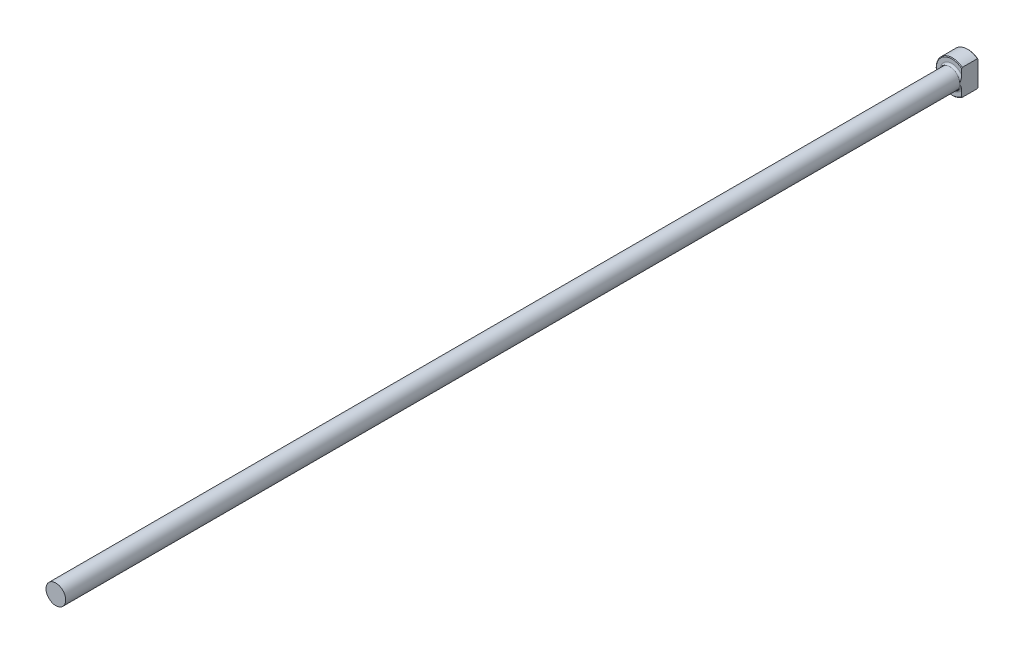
ISO-10303-21;
HEADER;
FILE_DESCRIPTION(('STEP AP214'),'2;1');
FILE_NAME('part.step','',(''),(''),'','','');
FILE_SCHEMA(('AUTOMOTIVE_DESIGN { 1 0 10303 214 1 1 1 1 }'));
ENDSEC;
DATA;
#1=APPLICATION_CONTEXT('core data for automotive mechanical design processes');
#2=APPLICATION_PROTOCOL_DEFINITION('international standard','automotive_design',2000,#1);
#3=PRODUCT_CONTEXT('',#1,'mechanical');
#4=PRODUCT('Part','Part','',(#3));
#5=PRODUCT_RELATED_PRODUCT_CATEGORY('part','',(#4));
#6=PRODUCT_DEFINITION_FORMATION('','',#4);
#7=PRODUCT_DEFINITION_CONTEXT('part definition',#1,'design');
#8=PRODUCT_DEFINITION('design','',#6,#7);
#9=PRODUCT_DEFINITION_SHAPE('','',#8);
#10=(LENGTH_UNIT() NAMED_UNIT(*) SI_UNIT(.MILLI.,.METRE.));
#11=(NAMED_UNIT(*) PLANE_ANGLE_UNIT() SI_UNIT($,.RADIAN.));
#12=(NAMED_UNIT(*) SI_UNIT($,.STERADIAN.) SOLID_ANGLE_UNIT());
#13=UNCERTAINTY_MEASURE_WITH_UNIT(LENGTH_MEASURE(1.E-05),#10,'distance_accuracy_value','');
#14=(GEOMETRIC_REPRESENTATION_CONTEXT(3) GLOBAL_UNCERTAINTY_ASSIGNED_CONTEXT((#13)) GLOBAL_UNIT_ASSIGNED_CONTEXT((#10,
#11,#12)) REPRESENTATION_CONTEXT('',''));
#15=CARTESIAN_POINT('',(0.,0.,0.));
#16=DIRECTION('',(0.,0.,1.));
#17=DIRECTION('',(1.,0.,0.));
#18=AXIS2_PLACEMENT_3D('',#15,#16,#17);
#19=CARTESIAN_POINT('',(0.,3.83285999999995,355.6));
#20=DIRECTION('',(0.,0.,1.));
#21=DIRECTION('',(1.,0.,0.));
#22=AXIS2_PLACEMENT_3D('',#19,#20,#21);
#23=PLANE('',#22);
#24=CARTESIAN_POINT('',(0.,0.,355.6));
#25=DIRECTION('',(0.,0.,-1.));
#26=DIRECTION('',(-1.,0.,0.));
#27=AXIS2_PLACEMENT_3D('',#24,#25,#26);
#28=CIRCLE('',#27,3.83285999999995);
#29=CARTESIAN_POINT('',(-3.83285999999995,0.,355.6));
#30=VERTEX_POINT('',#29);
#31=EDGE_CURVE('E96',#30,#30,#28,.T.);
#32=ORIENTED_EDGE('',*,*,#31,.F.);
#33=EDGE_LOOP('',(#32));
#34=FACE_BOUND('',#33,.T.);
#35=ADVANCED_FACE('F32',(#34),#23,.T.);
#36=CARTESIAN_POINT('',(0.,0.,-25.4347445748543));
#37=DIRECTION('',(0.,0.,-1.));
#38=DIRECTION('',(-1.,0.,0.));
#39=AXIS2_PLACEMENT_3D('',#36,#37,#38);
#40=CYLINDRICAL_SURFACE('',#39,3.83285999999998);
#41=ORIENTED_EDGE('',*,*,#31,.T.);
#42=EDGE_LOOP('',(#41));
#43=FACE_BOUND('',#42,.T.);
#44=CARTESIAN_POINT('',(0.,0.,7.112));
#45=DIRECTION('',(0.,0.,-1.));
#46=DIRECTION('',(-1.,0.,0.));
#47=AXIS2_PLACEMENT_3D('',#44,#45,#46);
#48=CIRCLE('',#47,3.83286);
#49=CARTESIAN_POINT('',(3.83286,0.,7.112));
#50=VERTEX_POINT('',#49);
#51=EDGE_CURVE('E101',#50,#50,#48,.T.);
#52=ORIENTED_EDGE('',*,*,#51,.F.);
#53=EDGE_LOOP('',(#52));
#54=FACE_BOUND('',#53,.T.);
#55=ADVANCED_FACE('F158',(#43,#54),#40,.T.);
#56=CARTESIAN_POINT('',(0.,0.,7.112));
#57=DIRECTION('',(0.,0.,-1.));
#58=DIRECTION('',(-1.,0.,0.));
#59=AXIS2_PLACEMENT_3D('',#56,#57,#58);
#60=TOROIDAL_SURFACE('',#59,4.59486,0.761999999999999);
#61=CARTESIAN_POINT('',(3.83286,0.,7.112));
#62=CARTESIAN_POINT('',(3.83286,5.1372426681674E-12,7.11200100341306));
#63=CARTESIAN_POINT('',(3.83286,-1.84401482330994E-07,7.11200200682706));
#64=CARTESIAN_POINT('',(3.83286,-7.83749542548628E-07,7.11200394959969));
#65=CARTESIAN_POINT('',(3.83286,-1.20317456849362E-06,7.11200488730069));
#66=CARTESIAN_POINT('',(3.83286,-2.21582954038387E-06,7.11200675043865));
#67=CARTESIAN_POINT('',(3.83286,-2.81940484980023E-06,7.11200767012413));
#68=CARTESIAN_POINT('',(3.83286,-4.13151427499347E-06,7.11200941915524));
#69=CARTESIAN_POINT('',(3.83286,-4.83940307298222E-06,7.11201024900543));
#70=CARTESIAN_POINT('',(3.83286,-7.34409210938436E-06,7.11201297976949));
#71=CARTESIAN_POINT('',(3.83286,-9.27908273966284E-06,7.11201475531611));
#72=CARTESIAN_POINT('',(3.83286,-1.33126172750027E-05,7.11201796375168));
#73=CARTESIAN_POINT('',(3.83286,-1.54049133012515E-05,7.11201940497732));
#74=CARTESIAN_POINT('',(3.83286,-2.3429417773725E-05,7.11202469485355));
#75=CARTESIAN_POINT('',(3.83286,-2.95585465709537E-05,7.11202825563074));
#76=CARTESIAN_POINT('',(3.83286,-4.1756384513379E-05,7.11203419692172));
#77=CARTESIAN_POINT('',(3.83286,-4.77919042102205E-05,7.11203664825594));
#78=CARTESIAN_POINT('',(3.83286,-7.30995036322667E-05,7.11204684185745));
#79=CARTESIAN_POINT('',(3.83286,-9.24260410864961E-05,7.11205441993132));
#80=CARTESIAN_POINT('',(3.83286,-0.000128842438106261,7.11206680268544));
#81=CARTESIAN_POINT('',(3.83286,-0.000145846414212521,7.11207185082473));
#82=CARTESIAN_POINT('',(3.83286,-0.00026771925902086,7.11211122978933));
#83=CARTESIAN_POINT('',(3.83286,-0.000367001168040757,7.11216062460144));
#84=CARTESIAN_POINT('',(3.83285999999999,-0.000750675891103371,7.11234439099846));
#85=CARTESIAN_POINT('',(3.83286,-0.00103895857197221,7.11246757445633));
#86=CARTESIAN_POINT('',(3.83286,-0.00214981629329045,7.11294946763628));
#87=CARTESIAN_POINT('',(3.83286,-0.00296838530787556,7.11331990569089));
#88=CARTESIAN_POINT('',(3.83285999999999,-0.00629134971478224,7.11481628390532));
#89=CARTESIAN_POINT('',(3.83285999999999,-0.00880018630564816,7.1159289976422));
#90=CARTESIAN_POINT('',(3.83286,-0.0428065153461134,7.1310208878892));
#91=CARTESIAN_POINT('',(3.83286,-0.0742721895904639,7.14509546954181));
#92=CARTESIAN_POINT('',(3.83285999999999,-0.137677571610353,7.17335406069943));
#93=CARTESIAN_POINT('',(3.83285999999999,-0.169617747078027,7.18753684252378));
#94=CARTESIAN_POINT('',(3.83286,-0.262759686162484,7.22878891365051));
#95=CARTESIAN_POINT('',(3.83286,-0.323998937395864,7.25577707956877));
#96=CARTESIAN_POINT('',(3.83285999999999,-0.453647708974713,7.31227321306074));
#97=CARTESIAN_POINT('',(3.83286,-0.522083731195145,7.34172035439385));
#98=CARTESIAN_POINT('',(3.83286,-0.660043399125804,7.39994279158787));
#99=CARTESIAN_POINT('',(3.83286,-0.729571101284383,7.42870853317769));
#100=CARTESIAN_POINT('',(3.83286,-0.851649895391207,7.4778300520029));
#101=CARTESIAN_POINT('',(3.83286,-0.904080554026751,7.49848404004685));
#102=CARTESIAN_POINT('',(3.83286,-1.00917368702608,7.53881244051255));
#103=CARTESIAN_POINT('',(3.83286,-1.0618353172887,7.55848905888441));
#104=CARTESIAN_POINT('',(3.83286,-1.21820008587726,7.61505972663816));
#105=CARTESIAN_POINT('',(3.83286,-1.32248111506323,7.65039413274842));
#106=CARTESIAN_POINT('',(3.83286,-1.50722237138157,7.7074093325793));
#107=CARTESIAN_POINT('',(3.83286,-1.58730108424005,7.7303198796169));
#108=CARTESIAN_POINT('',(3.83286,-1.74899373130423,7.77219093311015));
#109=CARTESIAN_POINT('',(3.83286,-1.8306138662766,7.79112782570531));
#110=CARTESIAN_POINT('',(3.83286,-1.99923752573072,7.82482137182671));
#111=CARTESIAN_POINT('',(3.83286,-2.08629719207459,7.83930345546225));
#112=CARTESIAN_POINT('',(3.83286,-2.26113871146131,7.86132193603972));
#113=CARTESIAN_POINT('',(3.83286,-2.34891861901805,7.86887313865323));
#114=CARTESIAN_POINT('',(3.83286,-2.52632401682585,7.87550229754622));
#115=CARTESIAN_POINT('',(3.83286,-2.6159557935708,7.87443621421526));
#116=CARTESIAN_POINT('',(3.83286,-2.79355853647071,7.86135706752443));
#117=CARTESIAN_POINT('',(3.83286,-2.88153691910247,7.84946479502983));
#118=CARTESIAN_POINT('',(3.83286,-3.0365103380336,7.81608676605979));
#119=CARTESIAN_POINT('',(3.83286,-3.10403894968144,7.79713375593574));
#120=CARTESIAN_POINT('',(3.83286,-3.23560259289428,7.74907140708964));
#121=CARTESIAN_POINT('',(3.83286,-3.29963669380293,7.71995937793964));
#122=CARTESIAN_POINT('',(3.83286,-3.39975931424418,7.66207658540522));
#123=CARTESIAN_POINT('',(3.83286,-3.43781401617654,7.63671754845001));
#124=CARTESIAN_POINT('',(3.83286,-3.50967039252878,7.58055410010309));
#125=CARTESIAN_POINT('',(3.83286,-3.54347947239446,7.54975940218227));
#126=CARTESIAN_POINT('',(3.83286,-3.59888331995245,7.48937028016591));
#127=CARTESIAN_POINT('',(3.83286,-3.62156698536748,7.46078082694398));
#128=CARTESIAN_POINT('',(3.83286,-3.66199074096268,7.40026011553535));
#129=CARTESIAN_POINT('',(3.83286,-3.67973258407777,7.36833004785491));
#130=CARTESIAN_POINT('',(3.83286,-3.70923964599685,7.30142426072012));
#131=CARTESIAN_POINT('',(3.83286,-3.72094850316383,7.26642327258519));
#132=CARTESIAN_POINT('',(3.83286,-3.73712661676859,7.19478679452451));
#133=CARTESIAN_POINT('',(3.83286,-3.74160343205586,7.15815305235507));
#134=CARTESIAN_POINT('',(3.83286,-3.74281702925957,7.09025005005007));
#135=CARTESIAN_POINT('',(3.83286,-3.74060851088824,7.05899550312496));
#136=CARTESIAN_POINT('',(3.83286,-3.73083078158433,6.99734466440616));
#137=CARTESIAN_POINT('',(3.83286,-3.72326195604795,6.9669483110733));
#138=CARTESIAN_POINT('',(3.83286,-3.70349352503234,6.9085123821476));
#139=CARTESIAN_POINT('',(3.83286,-3.69140578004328,6.88043442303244));
#140=CARTESIAN_POINT('',(3.83286,-3.66323831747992,6.82637595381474));
#141=CARTESIAN_POINT('',(3.83286,-3.6471572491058,6.80039615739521));
#142=CARTESIAN_POINT('',(3.83286,-3.60409738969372,6.74022410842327));
#143=CARTESIAN_POINT('',(3.83286,-3.57539723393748,6.70726160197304));
#144=CARTESIAN_POINT('',(3.83286,-3.51304174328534,6.64639156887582));
#145=CARTESIAN_POINT('',(3.83286,-3.47937425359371,6.61849682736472));
#146=CARTESIAN_POINT('',(3.83286,-3.39336233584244,6.55668780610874));
#147=CARTESIAN_POINT('',(3.83286,-3.33919733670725,6.52531725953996));
#148=CARTESIAN_POINT('',(3.83286,-3.22680929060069,6.47147878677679));
#149=CARTESIAN_POINT('',(3.83286,-3.16858777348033,6.44900752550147));
#150=CARTESIAN_POINT('',(3.83286,-3.01539196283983,6.40079211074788));
#151=CARTESIAN_POINT('',(3.83286,-2.91865907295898,6.38068848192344));
#152=CARTESIAN_POINT('',(3.83286,-2.7222597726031,6.35498278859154));
#153=CARTESIAN_POINT('',(3.83286,-2.62257144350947,6.34957773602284));
#154=CARTESIAN_POINT('',(3.83286,-2.43038804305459,6.35044050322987));
#155=CARTESIAN_POINT('',(3.83286,-2.3378828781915,6.35590978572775));
#156=CARTESIAN_POINT('',(3.83286,-2.15353769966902,6.37494656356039));
#157=CARTESIAN_POINT('',(3.83286,-2.06169979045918,6.38853328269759));
#158=CARTESIAN_POINT('',(3.83286,-1.88398991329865,6.42132274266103));
#159=CARTESIAN_POINT('',(3.83286,-1.79805564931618,6.44019749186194));
#160=CARTESIAN_POINT('',(3.83286,-1.62788552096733,6.48253570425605));
#161=CARTESIAN_POINT('',(3.83286,-1.54364260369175,6.50597126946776));
#162=CARTESIAN_POINT('',(3.83286,-1.35234096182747,6.56382052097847));
#163=CARTESIAN_POINT('',(3.83286,-1.24565429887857,6.59945637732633));
#164=CARTESIAN_POINT('',(3.83286,-1.08572048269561,6.65671248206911));
#165=CARTESIAN_POINT('',(3.83286,-1.03186009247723,6.67666194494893));
#166=CARTESIAN_POINT('',(3.83286,-0.924388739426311,6.71760226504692));
#167=CARTESIAN_POINT('',(3.83286,-0.870778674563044,6.73859548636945));
#168=CARTESIAN_POINT('',(3.83286,-0.745906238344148,6.78859605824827));
#169=CARTESIAN_POINT('',(3.83285999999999,-0.674772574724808,6.81792361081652));
#170=CARTESIAN_POINT('',(3.83286,-0.53364507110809,6.87733233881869));
#171=CARTESIAN_POINT('',(3.83286,-0.463646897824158,6.9074032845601));
#172=CARTESIAN_POINT('',(3.83285999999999,-0.33105350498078,6.96512294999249));
#173=CARTESIAN_POINT('',(3.83285999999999,-0.268429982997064,6.99270666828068));
#174=CARTESIAN_POINT('',(3.83286,-0.173185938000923,7.03487831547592));
#175=CARTESIAN_POINT('',(3.83286,-0.14052519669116,7.04937904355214));
#176=CARTESIAN_POINT('',(3.83285999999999,-0.0756904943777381,7.07827268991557));
#177=CARTESIAN_POINT('',(3.83285999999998,-0.0435160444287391,7.09266432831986));
#178=CARTESIAN_POINT('',(3.83286,-0.00880011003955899,7.1080710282));
#179=CARTESIAN_POINT('',(3.83286,-0.00629120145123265,7.10918378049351));
#180=CARTESIAN_POINT('',(3.83285999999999,-0.00296821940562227,7.11068016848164));
#181=CARTESIAN_POINT('',(3.83285999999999,-0.00214970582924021,7.11105058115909));
#182=CARTESIAN_POINT('',(3.83286,-0.00103891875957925,7.1115324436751));
#183=CARTESIAN_POINT('',(3.83286,-0.000750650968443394,7.11165562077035));
#184=CARTESIAN_POINT('',(3.83285999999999,-0.000366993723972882,7.11183937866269));
#185=CARTESIAN_POINT('',(3.83285999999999,-0.000267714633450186,7.11188877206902));
#186=CARTESIAN_POINT('',(3.83286,-0.000145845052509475,7.11192815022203));
#187=CARTESIAN_POINT('',(3.83286,-0.00012884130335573,7.11193319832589));
#188=CARTESIAN_POINT('',(3.83286,-9.24253977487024E-05,7.11194558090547));
#189=CARTESIAN_POINT('',(3.83286,-7.30991186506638E-05,7.11195315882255));
#190=CARTESIAN_POINT('',(3.83286,-4.77918096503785E-05,7.11196335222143));
#191=CARTESIAN_POINT('',(3.83286,-4.17563269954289E-05,7.11196580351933));
#192=CARTESIAN_POINT('',(3.83286,-2.9558557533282E-05,7.11197174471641));
#193=CARTESIAN_POINT('',(3.83286,-2.34294589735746E-05,7.11197530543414));
#194=CARTESIAN_POINT('',(3.83286,-1.54049822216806E-05,7.11198059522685));
#195=CARTESIAN_POINT('',(3.83286,-1.33126891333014E-05,7.11198203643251));
#196=CARTESIAN_POINT('',(3.83286,-9.27915642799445E-06,7.11198524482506));
#197=CARTESIAN_POINT('',(3.83286,-7.34416453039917E-06,7.11198702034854));
#198=CARTESIAN_POINT('',(3.83286,-4.83946889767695E-06,7.11198975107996));
#199=CARTESIAN_POINT('',(3.83286,-4.1315772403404E-06,7.11199058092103));
#200=CARTESIAN_POINT('',(3.83286,-2.81946047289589E-06,7.11199232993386));
#201=CARTESIAN_POINT('',(3.83286,-2.21588066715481E-06,7.11199324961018));
#202=CARTESIAN_POINT('',(3.83286,-1.20321479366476E-06,7.11199511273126));
#203=CARTESIAN_POINT('',(3.83286,-7.83783545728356E-07,7.11199605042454));
#204=CARTESIAN_POINT('',(3.83286,-1.84420470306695E-07,7.11199799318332));
#205=CARTESIAN_POINT('',(3.83286,-5.13722092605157E-12,7.11199899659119));
#206=CARTESIAN_POINT('',(3.83286,0.,7.112));
#207=B_SPLINE_CURVE_WITH_KNOTS('',3,(#61,#62,#63,#64,#65,#66,#67,#68,#69,#70,#71,#72,#73,#74,
#75,#76,#77,#78,#79,#80,#81,#82,#83,#84,#85,#86,#87,#88,#89,#90,#91,#92,#93,#94,#95,#96,#97,#98,
#99,#100,#101,#102,#103,#104,#105,#106,#107,#108,#109,#110,#111,#112,#113,#114,#115,#116,#117,
#118,#119,#120,#121,#122,#123,#124,#125,#126,#127,#128,#129,#130,#131,#132,#133,#134,#135,#136,
#137,#138,#139,#140,#141,#142,#143,#144,#145,#146,#147,#148,#149,#150,#151,#152,#153,#154,#155,
#156,#157,#158,#159,#160,#161,#162,#163,#164,#165,#166,#167,#168,#169,#170,#171,#172,#173,#174,
#175,#176,#177,#178,#179,#180,#181,#182,#183,#184,#185,#186,#187,#188,#189,#190,#191,#192,#193,
#194,#195,#196,#197,#198,#199,#200,#201,#202,#203,#204,#205,#206),.UNSPECIFIED.,.T.,.F.,(4,2,2,
2,2,2,2,2,2,2,2,2,2,2,2,2,2,2,2,2,2,2,2,2,2,2,2,2,2,2,2,2,2,2,2,2,2,2,2,2,2,2,2,2,2,2,2,2,2,2,2,
2,2,2,2,2,2,2,2,2,2,2,2,2,2,2,2,2,2,2,2,2,4),(0.,3.00744662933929E-06,6.07432337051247E-06,
9.36216964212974E-06,1.26304695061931E-05,2.04700799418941E-05,2.80858346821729E-05,
4.92763740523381E-05,6.87996269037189E-05,0.0001310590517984,0.000184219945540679,
0.000515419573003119,0.0014571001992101,0.00415108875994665,0.012386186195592,0.115783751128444,
0.220629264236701,0.421393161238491,0.644896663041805,0.870615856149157,1.039663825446,
1.20831108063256,1.53848493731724,1.78827587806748,2.03951163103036,2.30405571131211,
2.56803335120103,2.83643243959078,3.10187314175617,3.31168659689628,3.52155565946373,
3.65833864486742,3.79487963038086,3.90395037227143,4.01298237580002,4.12301531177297,
4.23293316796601,4.32645911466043,4.41997833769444,4.51132129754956,4.60269519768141,
4.73308310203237,4.8637955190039,5.05052762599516,5.23718968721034,5.53194746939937,
5.83063699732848,6.10820144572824,6.38642584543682,6.65021345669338,6.91243553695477,
7.24972179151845,7.42202431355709,7.59473665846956,7.8255509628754,8.05409849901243,
8.25938288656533,8.36659124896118,8.47231788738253,8.48055322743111,8.48324703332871,
8.4841886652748,8.48451985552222,8.48457301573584,8.48463527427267,8.48465479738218,
8.48467598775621,8.48468360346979,8.4846914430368,8.48469471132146,8.48469799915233,
8.4847010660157,8.4847040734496),.UNSPECIFIED.);
#208=CARTESIAN_POINT('',(3.83286,-2.53415126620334,6.35));
#209=VERTEX_POINT('',#208);
#210=EDGE_CURVE('E142',#209,#50,#207,.T.);
#211=ORIENTED_EDGE('',*,*,#210,.T.);
#212=ORIENTED_EDGE('',*,*,#51,.T.);
#213=CARTESIAN_POINT('',(3.83286,0.,7.112));
#214=CARTESIAN_POINT('',(3.83286,-5.13725794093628E-12,7.11199899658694));
#215=CARTESIAN_POINT('',(3.83286,1.8440148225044E-07,7.11199799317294));
#216=CARTESIAN_POINT('',(3.83286,7.83749542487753E-07,7.11199605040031));
#217=CARTESIAN_POINT('',(3.83286,1.20317456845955E-06,7.11199511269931));
#218=CARTESIAN_POINT('',(3.83286,2.21582954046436E-06,7.11199324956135));
#219=CARTESIAN_POINT('',(3.83286,2.8194048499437E-06,7.11199232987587));
#220=CARTESIAN_POINT('',(3.83286,4.13151427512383E-06,7.11199058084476));
#221=CARTESIAN_POINT('',(3.83286,4.83940307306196E-06,7.11198975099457));
#222=CARTESIAN_POINT('',(3.83286,7.34409210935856E-06,7.11198702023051));
#223=CARTESIAN_POINT('',(3.83286,9.27908273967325E-06,7.11198524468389));
#224=CARTESIAN_POINT('',(3.83286,1.33126172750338E-05,7.11198203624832));
#225=CARTESIAN_POINT('',(3.83286,1.54049133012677E-05,7.11198059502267));
#226=CARTESIAN_POINT('',(3.83286,2.34294177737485E-05,7.11197530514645));
#227=CARTESIAN_POINT('',(3.83286,2.95585465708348E-05,7.11197174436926));
#228=CARTESIAN_POINT('',(3.83286,4.17563845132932E-05,7.11196580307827));
#229=CARTESIAN_POINT('',(3.83286,4.77919042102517E-05,7.11196335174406));
#230=CARTESIAN_POINT('',(3.83286,7.30995036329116E-05,7.11195315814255));
#231=CARTESIAN_POINT('',(3.83286,9.24260410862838E-05,7.11194558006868));
#232=CARTESIAN_POINT('',(3.83286,0.000128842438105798,7.11193319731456));
#233=CARTESIAN_POINT('',(3.83286,0.000145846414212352,7.11192814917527));
#234=CARTESIAN_POINT('',(3.83286,0.000267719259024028,7.11188877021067));
#235=CARTESIAN_POINT('',(3.83286,0.000367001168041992,7.11183937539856));
#236=CARTESIAN_POINT('',(3.83285999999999,0.00075067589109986,7.11165560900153));
#237=CARTESIAN_POINT('',(3.83286,0.00103895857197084,7.11153242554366));
#238=CARTESIAN_POINT('',(3.83286,0.00214981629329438,7.11105053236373));
#239=CARTESIAN_POINT('',(3.83286,0.00296838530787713,7.11068009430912));
#240=CARTESIAN_POINT('',(3.83285999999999,0.00629134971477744,7.10918371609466));
#241=CARTESIAN_POINT('',(3.83285999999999,0.00880018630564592,7.10807100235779));
#242=CARTESIAN_POINT('',(3.83286,0.0428065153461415,7.09297911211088));
#243=CARTESIAN_POINT('',(3.83286,0.0742721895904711,7.07890453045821));
#244=CARTESIAN_POINT('',(3.83285999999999,0.137677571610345,7.05064593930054));
#245=CARTESIAN_POINT('',(3.83285999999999,0.169617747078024,7.03646315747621));
#246=CARTESIAN_POINT('',(3.83286,0.26275968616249,6.9952110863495));
#247=CARTESIAN_POINT('',(3.83286,0.323998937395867,6.96822292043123));
#248=CARTESIAN_POINT('',(3.83285999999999,0.453647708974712,6.91172678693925));
#249=CARTESIAN_POINT('',(3.83286,0.522083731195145,6.88227964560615));
#250=CARTESIAN_POINT('',(3.83286,0.660043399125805,6.82405720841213));
#251=CARTESIAN_POINT('',(3.83286,0.729571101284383,6.79529146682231));
#252=CARTESIAN_POINT('',(3.83286,0.851649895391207,6.7461699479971));
#253=CARTESIAN_POINT('',(3.83286,0.904080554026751,6.72551595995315));
#254=CARTESIAN_POINT('',(3.83286,1.00917368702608,6.68518755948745));
#255=CARTESIAN_POINT('',(3.83286,1.0618353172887,6.66551094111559));
#256=CARTESIAN_POINT('',(3.83286,1.21820008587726,6.60894027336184));
#257=CARTESIAN_POINT('',(3.83286,1.32248111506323,6.57360586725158));
#258=CARTESIAN_POINT('',(3.83286,1.50722237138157,6.5165906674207));
#259=CARTESIAN_POINT('',(3.83286,1.58730108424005,6.4936801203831));
#260=CARTESIAN_POINT('',(3.83286,1.74899373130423,6.45180906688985));
#261=CARTESIAN_POINT('',(3.83286,1.8306138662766,6.43287217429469));
#262=CARTESIAN_POINT('',(3.83286,1.99923752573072,6.39917862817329));
#263=CARTESIAN_POINT('',(3.83286,2.08629719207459,6.38469654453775));
#264=CARTESIAN_POINT('',(3.83286,2.26113871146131,6.36267806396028));
#265=CARTESIAN_POINT('',(3.83286,2.34891861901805,6.35512686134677));
#266=CARTESIAN_POINT('',(3.83286,2.52632401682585,6.34849770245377));
#267=CARTESIAN_POINT('',(3.83286,2.6159557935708,6.34956378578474));
#268=CARTESIAN_POINT('',(3.83286,2.79355853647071,6.36264293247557));
#269=CARTESIAN_POINT('',(3.83286,2.88153691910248,6.37453520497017));
#270=CARTESIAN_POINT('',(3.83286,3.03651033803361,6.40791323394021));
#271=CARTESIAN_POINT('',(3.83286,3.10403894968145,6.42686624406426));
#272=CARTESIAN_POINT('',(3.83286,3.23560259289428,6.47492859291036));
#273=CARTESIAN_POINT('',(3.83286,3.29963669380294,6.50404062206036));
#274=CARTESIAN_POINT('',(3.83286,3.39975931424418,6.56192341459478));
#275=CARTESIAN_POINT('',(3.83286,3.43781401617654,6.58728245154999));
#276=CARTESIAN_POINT('',(3.83286,3.50967039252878,6.64344589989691));
#277=CARTESIAN_POINT('',(3.83286,3.54347947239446,6.67424059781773));
#278=CARTESIAN_POINT('',(3.83286,3.59888331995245,6.73462971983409));
#279=CARTESIAN_POINT('',(3.83286,3.62156698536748,6.76321917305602));
#280=CARTESIAN_POINT('',(3.83286,3.66199074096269,6.82373988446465));
#281=CARTESIAN_POINT('',(3.83286,3.67973258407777,6.85566995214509));
#282=CARTESIAN_POINT('',(3.83286,3.70923964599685,6.92257573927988));
#283=CARTESIAN_POINT('',(3.83286,3.72094850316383,6.95757672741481));
#284=CARTESIAN_POINT('',(3.83286,3.73712661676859,7.02921320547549));
#285=CARTESIAN_POINT('',(3.83286,3.74160343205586,7.06584694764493));
#286=CARTESIAN_POINT('',(3.83286,3.74281702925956,7.13374994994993));
#287=CARTESIAN_POINT('',(3.83286,3.74060851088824,7.16500449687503));
#288=CARTESIAN_POINT('',(3.83286,3.73083078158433,7.22665533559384));
#289=CARTESIAN_POINT('',(3.83286,3.72326195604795,7.2570516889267));
#290=CARTESIAN_POINT('',(3.83286,3.70349352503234,7.3154876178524));
#291=CARTESIAN_POINT('',(3.83286,3.69140578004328,7.34356557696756));
#292=CARTESIAN_POINT('',(3.83286,3.66323831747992,7.39762404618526));
#293=CARTESIAN_POINT('',(3.83286,3.6471572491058,7.42360384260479));
#294=CARTESIAN_POINT('',(3.83286,3.60409738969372,7.48377589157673));
#295=CARTESIAN_POINT('',(3.83286,3.57539723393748,7.51673839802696));
#296=CARTESIAN_POINT('',(3.83286,3.51304174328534,7.57760843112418));
#297=CARTESIAN_POINT('',(3.83286,3.47937425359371,7.60550317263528));
#298=CARTESIAN_POINT('',(3.83286,3.39336233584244,7.66731219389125));
#299=CARTESIAN_POINT('',(3.83286,3.33919733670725,7.69868274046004));
#300=CARTESIAN_POINT('',(3.83286,3.22680929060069,7.75252121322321));
#301=CARTESIAN_POINT('',(3.83286,3.16858777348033,7.77499247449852));
#302=CARTESIAN_POINT('',(3.83286,3.01539196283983,7.82320788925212));
#303=CARTESIAN_POINT('',(3.83286,2.91865907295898,7.84331151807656));
#304=CARTESIAN_POINT('',(3.83286,2.7222597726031,7.86901721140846));
#305=CARTESIAN_POINT('',(3.83286,2.62257144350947,7.87442226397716));
#306=CARTESIAN_POINT('',(3.83286,2.43038804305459,7.87355949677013));
#307=CARTESIAN_POINT('',(3.83286,2.3378828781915,7.86809021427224));
#308=CARTESIAN_POINT('',(3.83286,2.15353769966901,7.84905343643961));
#309=CARTESIAN_POINT('',(3.83286,2.06169979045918,7.83546671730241));
#310=CARTESIAN_POINT('',(3.83286,1.88398991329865,7.80267725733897));
#311=CARTESIAN_POINT('',(3.83286,1.79805564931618,7.78380250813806));
#312=CARTESIAN_POINT('',(3.83286,1.62788552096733,7.74146429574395));
#313=CARTESIAN_POINT('',(3.83286,1.54364260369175,7.71802873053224));
#314=CARTESIAN_POINT('',(3.83286,1.35234096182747,7.66017947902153));
#315=CARTESIAN_POINT('',(3.83286,1.24565429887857,7.62454362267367));
#316=CARTESIAN_POINT('',(3.83286,1.08572048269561,7.56728751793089));
#317=CARTESIAN_POINT('',(3.83286,1.03186009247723,7.54733805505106));
#318=CARTESIAN_POINT('',(3.83286,0.92438873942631,7.50639773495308));
#319=CARTESIAN_POINT('',(3.83286,0.870778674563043,7.48540451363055));
#320=CARTESIAN_POINT('',(3.83286,0.745906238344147,7.43540394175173));
#321=CARTESIAN_POINT('',(3.83285999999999,0.674772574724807,7.40607638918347));
#322=CARTESIAN_POINT('',(3.83286,0.533645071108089,7.34666766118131));
#323=CARTESIAN_POINT('',(3.83286,0.463646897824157,7.31659671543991));
#324=CARTESIAN_POINT('',(3.83285999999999,0.33105350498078,7.25887705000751));
#325=CARTESIAN_POINT('',(3.83285999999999,0.268429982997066,7.23129333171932));
#326=CARTESIAN_POINT('',(3.83286,0.173185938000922,7.18912168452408));
#327=CARTESIAN_POINT('',(3.83286,0.140525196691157,7.17462095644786));
#328=CARTESIAN_POINT('',(3.83285999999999,0.0756904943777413,7.14572731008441));
#329=CARTESIAN_POINT('',(3.83285999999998,0.043516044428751,7.1313356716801));
#330=CARTESIAN_POINT('',(3.83286,0.00880011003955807,7.1159289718));
#331=CARTESIAN_POINT('',(3.83286,0.00629120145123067,7.11481621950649));
#332=CARTESIAN_POINT('',(3.83285999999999,0.00296821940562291,7.11331983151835));
#333=CARTESIAN_POINT('',(3.83285999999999,0.00214970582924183,7.1129494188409));
#334=CARTESIAN_POINT('',(3.83286,0.00103891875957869,7.1124675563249));
#335=CARTESIAN_POINT('',(3.83286,0.000750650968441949,7.11234437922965));
#336=CARTESIAN_POINT('',(3.83285999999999,0.00036699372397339,7.11216062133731));
#337=CARTESIAN_POINT('',(3.83285999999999,0.000267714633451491,7.11211122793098));
#338=CARTESIAN_POINT('',(3.83286,0.000145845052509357,7.11207184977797));
#339=CARTESIAN_POINT('',(3.83286,0.000128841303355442,7.11206680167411));
#340=CARTESIAN_POINT('',(3.83286,9.24253977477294E-05,7.11205441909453));
#341=CARTESIAN_POINT('',(3.83286,7.30991186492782E-05,7.11204684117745));
#342=CARTESIAN_POINT('',(3.83286,4.77918096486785E-05,7.11203664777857));
#343=CARTESIAN_POINT('',(3.83286,4.17563269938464E-05,7.11203419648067));
#344=CARTESIAN_POINT('',(3.83286,2.9558557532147E-05,7.11202825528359));
#345=CARTESIAN_POINT('',(3.83286,2.34294589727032E-05,7.11202469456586));
#346=CARTESIAN_POINT('',(3.83286,1.5404982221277E-05,7.11201940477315));
#347=CARTESIAN_POINT('',(3.83286,1.33126891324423E-05,7.11201796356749));
#348=CARTESIAN_POINT('',(3.83286,9.2791564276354E-06,7.11201475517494));
#349=CARTESIAN_POINT('',(3.83286,7.34416453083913E-06,7.11201297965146));
#350=CARTESIAN_POINT('',(3.83286,4.83946889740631E-06,7.11201024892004));
#351=CARTESIAN_POINT('',(3.83286,4.13157723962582E-06,7.11200941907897));
#352=CARTESIAN_POINT('',(3.83286,2.81946047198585E-06,7.11200767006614));
#353=CARTESIAN_POINT('',(3.83286,2.21588066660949E-06,7.11200675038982));
#354=CARTESIAN_POINT('',(3.83286,1.203214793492E-06,7.11200488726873));
#355=CARTESIAN_POINT('',(3.83286,7.83783545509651E-07,7.11200394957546));
#356=CARTESIAN_POINT('',(3.83286,1.84420470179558E-07,7.11200200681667));
#357=CARTESIAN_POINT('',(3.83286,5.13723619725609E-12,7.11200100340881));
#358=CARTESIAN_POINT('',(3.83286,0.,7.112));
#359=B_SPLINE_CURVE_WITH_KNOTS('',3,(#213,#214,#215,#216,#217,#218,#219,#220,#221,#222,#223,
#224,#225,#226,#227,#228,#229,#230,#231,#232,#233,#234,#235,#236,#237,#238,#239,#240,#241,#242,
#243,#244,#245,#246,#247,#248,#249,#250,#251,#252,#253,#254,#255,#256,#257,#258,#259,#260,#261,
#262,#263,#264,#265,#266,#267,#268,#269,#270,#271,#272,#273,#274,#275,#276,#277,#278,#279,#280,
#281,#282,#283,#284,#285,#286,#287,#288,#289,#290,#291,#292,#293,#294,#295,#296,#297,#298,#299,
#300,#301,#302,#303,#304,#305,#306,#307,#308,#309,#310,#311,#312,#313,#314,#315,#316,#317,#318,
#319,#320,#321,#322,#323,#324,#325,#326,#327,#328,#329,#330,#331,#332,#333,#334,#335,#336,#337,
#338,#339,#340,#341,#342,#343,#344,#345,#346,#347,#348,#349,#350,#351,#352,#353,#354,#355,#356,
#357,#358),.UNSPECIFIED.,.T.,.F.,(4,2,2,2,2,2,2,2,2,2,2,2,2,2,2,2,2,2,2,2,2,2,2,2,2,2,2,2,2,2,2,
2,2,2,2,2,2,2,2,2,2,2,2,2,2,2,2,2,2,2,2,2,2,2,2,2,2,2,2,2,2,2,2,2,2,2,2,2,2,2,2,2,4),(0.,
3.00744663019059E-06,6.07432337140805E-06,9.36216964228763E-06,1.26304695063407E-05,
2.04700799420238E-05,2.8085834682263E-05,4.92763740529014E-05,6.87996269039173E-05,
0.000131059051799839,0.000184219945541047,0.000515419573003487,0.00145710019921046,
0.00415108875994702,0.0123861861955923,0.115783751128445,0.220629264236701,0.421393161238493,
0.644896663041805,0.870615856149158,1.039663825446,1.20831108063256,1.53848493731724,
1.78827587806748,2.03951163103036,2.30405571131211,2.56803335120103,2.83643243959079,
3.10187314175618,3.31168659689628,3.52155565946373,3.65833864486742,3.79487963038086,
3.90395037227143,4.01298237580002,4.12301531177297,4.23293316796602,4.32645911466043,
4.41997833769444,4.51132129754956,4.60269519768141,4.73308310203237,4.8637955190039,
5.05052762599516,5.23718968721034,5.53194746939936,5.83063699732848,6.10820144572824,
6.38642584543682,6.65021345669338,6.91243553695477,7.24972179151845,7.42202431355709,
7.59473665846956,7.8255509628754,8.05409849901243,8.25938288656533,8.36659124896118,
8.47231788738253,8.48055322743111,8.48324703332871,8.4841886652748,8.48451985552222,
8.48457301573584,8.48463527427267,8.48465479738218,8.48467598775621,8.4846836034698,
8.4846914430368,8.48469471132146,8.48469799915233,8.4847010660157,8.4847040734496),.UNSPECIFIED.);
#360=CARTESIAN_POINT('',(3.83286,2.53415126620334,6.35));
#361=VERTEX_POINT('',#360);
#362=EDGE_CURVE('E136',#50,#361,#359,.T.);
#363=ORIENTED_EDGE('',*,*,#362,.T.);
#364=CARTESIAN_POINT('',(0.,0.,6.35));
#365=DIRECTION('',(0.,0.,-1.));
#366=DIRECTION('',(-1.,0.,0.));
#367=AXIS2_PLACEMENT_3D('',#364,#365,#366);
#368=CIRCLE('',#367,4.59486);
#369=EDGE_CURVE('E149',#209,#361,#368,.T.);
#370=ORIENTED_EDGE('',*,*,#369,.F.);
#371=EDGE_LOOP('',(#211,#212,#363,#370));
#372=FACE_BOUND('',#371,.T.);
#373=ADVANCED_FACE('F155',(#372),#60,.F.);
#374=CARTESIAN_POINT('',(0.,6.35,6.35));
#375=DIRECTION('',(0.,0.,1.));
#376=DIRECTION('',(1.,0.,0.));
#377=AXIS2_PLACEMENT_3D('',#374,#375,#376);
#378=PLANE('',#377);
#379=DIRECTION('',(0.,1.,0.));
#380=VECTOR('',#379,1.);
#381=CARTESIAN_POINT('',(3.83286,5.0627743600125,6.35000000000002));
#382=LINE('',#381,#380);
#383=CARTESIAN_POINT('',(3.83286,4.74029537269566,6.35));
#384=VERTEX_POINT('',#383);
#385=EDGE_CURVE('E112',#361,#384,#382,.T.);
#386=ORIENTED_EDGE('',*,*,#385,.T.);
#387=CARTESIAN_POINT('',(0.,0.,6.35));
#388=DIRECTION('',(0.,0.,1.));
#389=DIRECTION('',(1.,0.,0.));
#390=AXIS2_PLACEMENT_3D('',#387,#388,#389);
#391=CIRCLE('',#390,6.09599999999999);
#392=CARTESIAN_POINT('',(3.83286,-4.74029537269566,6.35));
#393=VERTEX_POINT('',#392);
#394=EDGE_CURVE('E11',#384,#393,#391,.T.);
#395=ORIENTED_EDGE('',*,*,#394,.T.);
#396=EDGE_CURVE('E47',#393,#209,#382,.T.);
#397=ORIENTED_EDGE('',*,*,#396,.T.);
#398=ORIENTED_EDGE('',*,*,#369,.T.);
#399=EDGE_LOOP('',(#386,#395,#397,#398));
#400=FACE_BOUND('',#399,.T.);
#401=ADVANCED_FACE('F166',(#400),#378,.T.);
#402=CARTESIAN_POINT('',(0.,0.,-25.4347445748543));
#403=DIRECTION('',(0.,0.,-1.));
#404=DIRECTION('',(-1.,0.,0.));
#405=AXIS2_PLACEMENT_3D('',#402,#403,#404);
#406=CYLINDRICAL_SURFACE('',#405,6.35);
#407=DIRECTION('',(0.,0.,-1.));
#408=VECTOR('',#407,1.);
#409=CARTESIAN_POINT('',(3.83286,5.0627743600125,355.601));
#410=LINE('',#409,#408);
#411=CARTESIAN_POINT('',(3.83286,5.0627743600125,6.09599999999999));
#412=VERTEX_POINT('',#411);
#413=CARTESIAN_POINT('',(3.83286,5.0627743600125,0.253999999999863));
#414=VERTEX_POINT('',#413);
#415=EDGE_CURVE('E108',#412,#414,#410,.T.);
#416=ORIENTED_EDGE('',*,*,#415,.T.);
#417=CARTESIAN_POINT('',(0.,0.,0.253999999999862));
#418=DIRECTION('',(0.,0.,-1.));
#419=DIRECTION('',(-1.,0.,0.));
#420=AXIS2_PLACEMENT_3D('',#417,#418,#419);
#421=CIRCLE('',#420,6.35);
#422=CARTESIAN_POINT('',(3.83286,-5.0627743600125,0.253999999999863));
#423=VERTEX_POINT('',#422);
#424=EDGE_CURVE('E40',#414,#423,#421,.F.);
#425=ORIENTED_EDGE('',*,*,#424,.T.);
#426=DIRECTION('',(0.,0.,-1.));
#427=VECTOR('',#426,1.);
#428=CARTESIAN_POINT('',(3.83286,-5.0627743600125,355.601));
#429=LINE('',#428,#427);
#430=CARTESIAN_POINT('',(3.83286,-5.0627743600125,6.09599999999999));
#431=VERTEX_POINT('',#430);
#432=EDGE_CURVE('E86',#431,#423,#429,.T.);
#433=ORIENTED_EDGE('',*,*,#432,.F.);
#434=CARTESIAN_POINT('',(0.,0.,6.09599999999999));
#435=DIRECTION('',(0.,0.,1.));
#436=DIRECTION('',(1.,0.,0.));
#437=AXIS2_PLACEMENT_3D('',#434,#435,#436);
#438=CIRCLE('',#437,6.35);
#439=EDGE_CURVE('E95',#431,#412,#438,.F.);
#440=ORIENTED_EDGE('',*,*,#439,.T.);
#441=EDGE_LOOP('',(#416,#425,#433,#440));
#442=FACE_BOUND('',#441,.T.);
#443=ADVANCED_FACE('F106',(#442),#406,.T.);
#444=CARTESIAN_POINT('',(0.,0.,0.));
#445=DIRECTION('',(0.,0.,-1.));
#446=DIRECTION('',(-1.,0.,0.));
#447=AXIS2_PLACEMENT_3D('',#444,#445,#446);
#448=PLANE('',#447);
#449=DIRECTION('',(0.,1.,0.));
#450=VECTOR('',#449,1.);
#451=CARTESIAN_POINT('',(3.83286,5.0627743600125,0.));
#452=LINE('',#451,#450);
#453=CARTESIAN_POINT('',(3.83286,-4.74029537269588,0.));
#454=VERTEX_POINT('',#453);
#455=CARTESIAN_POINT('',(3.83286,4.74029537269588,0.));
#456=VERTEX_POINT('',#455);
#457=EDGE_CURVE('E79',#454,#456,#452,.T.);
#458=ORIENTED_EDGE('',*,*,#457,.F.);
#459=CARTESIAN_POINT('',(0.,0.,0.));
#460=DIRECTION('',(0.,0.,-1.));
#461=DIRECTION('',(-1.,0.,0.));
#462=AXIS2_PLACEMENT_3D('',#459,#460,#461);
#463=CIRCLE('',#462,6.09600000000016);
#464=EDGE_CURVE('E91',#454,#456,#463,.T.);
#465=ORIENTED_EDGE('',*,*,#464,.T.);
#466=EDGE_LOOP('',(#458,#465));
#467=FACE_BOUND('',#466,.T.);
#468=ADVANCED_FACE('F94',(#467),#448,.T.);
#469=CARTESIAN_POINT('',(0.,0.,0.));
#470=DIRECTION('',(0.,0.,1.));
#471=DIRECTION('',(1.,0.,0.));
#472=AXIS2_PLACEMENT_3D('',#469,#470,#471);
#473=CONICAL_SURFACE('',#472,6.09600000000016,0.785398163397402);
#474=CARTESIAN_POINT('',(3.83286,11.1402147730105,5.68513750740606));
#475=CARTESIAN_POINT('',(3.83286,10.9596366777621,5.51438683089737));
#476=CARTESIAN_POINT('',(3.83286,10.7788428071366,5.34386413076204));
#477=CARTESIAN_POINT('',(3.83286,10.4167491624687,5.00335462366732));
#478=CARTESIAN_POINT('',(3.83286,10.2354493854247,4.83336781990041));
#479=CARTESIAN_POINT('',(3.83286,9.69029542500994,4.32397215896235));
#480=CARTESIAN_POINT('',(3.83286,9.32557160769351,3.98549273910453));
#481=CARTESIAN_POINT('',(3.83286,8.57862533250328,3.29873604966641));
#482=CARTESIAN_POINT('',(3.83286,8.19627736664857,2.95059480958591));
#483=CARTESIAN_POINT('',(3.83286,7.61929203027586,2.43261884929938));
#484=CARTESIAN_POINT('',(3.83286,7.42648181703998,2.26074948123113));
#485=CARTESIAN_POINT('',(3.83286,7.0393733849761,1.91869608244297));
#486=CARTESIAN_POINT('',(3.83286,6.84507518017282,1.74851203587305));
#487=CARTESIAN_POINT('',(3.83286,6.45489648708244,1.41046543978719));
#488=CARTESIAN_POINT('',(3.83286,6.25901830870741,1.24260022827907));
#489=CARTESIAN_POINT('',(3.83286,5.86497805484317,0.909546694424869));
#490=CARTESIAN_POINT('',(3.83286,5.6668158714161,0.744358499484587));
#491=CARTESIAN_POINT('',(3.83286,5.26697716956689,0.416959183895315));
#492=CARTESIAN_POINT('',(3.83286,5.06529142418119,0.254759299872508));
#493=CARTESIAN_POINT('',(3.83286,4.65823196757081,-0.0649108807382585));
#494=CARTESIAN_POINT('',(3.83286,4.45285877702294,-0.222381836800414));
#495=CARTESIAN_POINT('',(3.83286,4.04104844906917,-0.528039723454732));
#496=CARTESIAN_POINT('',(3.83286,3.83469824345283,-0.676343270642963));
#497=CARTESIAN_POINT('',(3.83286,3.41572607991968,-0.964262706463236));
#498=CARTESIAN_POINT('',(3.83286,3.20310000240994,-1.10387269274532));
#499=CARTESIAN_POINT('',(3.83286,2.8787683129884,-1.30319632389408));
#500=CARTESIAN_POINT('',(3.83286,2.77006485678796,-1.36779194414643));
#501=CARTESIAN_POINT('',(3.83286,2.55038602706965,-1.49305267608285));
#502=CARTESIAN_POINT('',(3.83286,2.43941039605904,-1.55371733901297));
#503=CARTESIAN_POINT('',(3.83286,2.21510425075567,-1.67012957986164));
#504=CARTESIAN_POINT('',(3.83286,2.10177743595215,-1.7258842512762));
#505=CARTESIAN_POINT('',(3.83286,1.8723969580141,-1.83145737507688));
#506=CARTESIAN_POINT('',(3.83286,1.75634409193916,-1.88127753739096));
#507=CARTESIAN_POINT('',(3.83286,1.58220111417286,-1.94974085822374));
#508=CARTESIAN_POINT('',(3.83286,1.52520228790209,-1.97117356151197));
#509=CARTESIAN_POINT('',(3.83286,1.41054471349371,-2.01218016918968));
#510=CARTESIAN_POINT('',(3.83286,1.35288600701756,-2.03175419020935));
#511=CARTESIAN_POINT('',(3.83286,1.17888964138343,-2.08744345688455));
#512=CARTESIAN_POINT('',(3.83286,1.06155284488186,-2.12051748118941));
#513=CARTESIAN_POINT('',(3.83286,0.825230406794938,-2.17697723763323));
#514=CARTESIAN_POINT('',(3.83286,0.706257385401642,-2.20041526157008));
#515=CARTESIAN_POINT('',(3.83286,0.466705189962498,-2.23664409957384));
#516=CARTESIAN_POINT('',(3.83286,0.346126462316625,-2.24943781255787));
#517=CARTESIAN_POINT('',(3.83286,0.103290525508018,-2.2636795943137));
#518=CARTESIAN_POINT('',(3.83286,-0.0189723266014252,-2.26503327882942));
#519=CARTESIAN_POINT('',(3.83286,-0.263058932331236,-2.25606033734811));
#520=CARTESIAN_POINT('',(3.83286,-0.384882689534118,-2.24573380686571));
#521=CARTESIAN_POINT('',(3.83286,-0.627600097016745,-2.21397131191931));
#522=CARTESIAN_POINT('',(3.83286,-0.748487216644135,-2.19248622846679));
#523=CARTESIAN_POINT('',(3.83286,-0.988050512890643,-2.13956298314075));
#524=CARTESIAN_POINT('',(3.83286,-1.10672618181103,-2.10812256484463));
#525=CARTESIAN_POINT('',(3.83286,-1.40515447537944,-2.01733434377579));
#526=CARTESIAN_POINT('',(3.83286,-1.58311025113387,-1.95210027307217));
#527=CARTESIAN_POINT('',(3.83286,-1.93265762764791,-1.80640183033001));
#528=CARTESIAN_POINT('',(3.83286,-2.10424420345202,-1.72592572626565));
#529=CARTESIAN_POINT('',(3.83286,-2.35811181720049,-1.59642564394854));
#530=CARTESIAN_POINT('',(3.83286,-2.44255477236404,-1.55155231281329));
#531=CARTESIAN_POINT('',(3.83286,-2.61009410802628,-1.45935168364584));
#532=CARTESIAN_POINT('',(3.83286,-2.69319047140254,-1.41202435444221));
#533=CARTESIAN_POINT('',(3.83286,-2.85811085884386,-1.31529342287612));
#534=CARTESIAN_POINT('',(3.83286,-2.93993543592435,-1.26589075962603));
#535=CARTESIAN_POINT('',(3.83286,-3.10245900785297,-1.16527967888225));
#536=CARTESIAN_POINT('',(3.83286,-3.1831580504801,-1.11407133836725));
#537=CARTESIAN_POINT('',(3.83286,-3.45463598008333,-0.938089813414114));
#538=CARTESIAN_POINT('',(3.83286,-3.6430552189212,-0.809671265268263));
#539=CARTESIAN_POINT('',(3.83286,-4.01542203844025,-0.546483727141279));
#540=CARTESIAN_POINT('',(3.83286,-4.1993685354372,-0.411713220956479));
#541=CARTESIAN_POINT('',(3.83286,-4.56386412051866,-0.137370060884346));
#542=CARTESIAN_POINT('',(3.83286,-4.74441036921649,0.00220635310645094));
#543=CARTESIAN_POINT('',(3.83286,-5.10266812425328,0.284904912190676));
#544=CARTESIAN_POINT('',(3.83286,-5.28037988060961,0.428026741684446));
#545=CARTESIAN_POINT('',(3.83286,-5.63414971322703,0.717522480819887));
#546=CARTESIAN_POINT('',(3.83286,-5.8102000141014,0.863905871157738));
#547=CARTESIAN_POINT('',(3.83286,-6.16045329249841,1.15886826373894));
#548=CARTESIAN_POINT('',(3.83286,-6.3346562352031,1.30744730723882));
#549=CARTESIAN_POINT('',(3.83286,-6.85484960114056,1.75566330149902));
#550=CARTESIAN_POINT('',(3.83286,-7.19858720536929,2.05791365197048));
#551=CARTESIAN_POINT('',(3.83286,-7.84601282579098,2.63507808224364));
#552=CARTESIAN_POINT('',(3.83286,-8.15011566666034,2.90952940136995));
#553=CARTESIAN_POINT('',(3.83286,-8.75586096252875,3.46121039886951));
#554=CARTESIAN_POINT('',(3.83286,-9.05750309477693,3.73844043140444));
#555=CARTESIAN_POINT('',(3.83286,-9.65683960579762,4.29305792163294));
#556=CARTESIAN_POINT('',(3.83286,-9.95454688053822,4.57043146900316));
#557=CARTESIAN_POINT('',(3.83286,-10.5484244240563,5.12672327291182));
#558=CARTESIAN_POINT('',(3.83286,-10.8445949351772,5.40564127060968));
#559=CARTESIAN_POINT('',(3.83286,-11.1402147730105,5.68513750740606));
#560=B_SPLINE_CURVE_WITH_KNOTS('',3,(#474,#475,#476,#477,#478,#479,#480,#481,#482,#483,#484,
#485,#486,#487,#488,#489,#490,#491,#492,#493,#494,#495,#496,#497,#498,#499,#500,#501,#502,#503,
#504,#505,#506,#507,#508,#509,#510,#511,#512,#513,#514,#515,#516,#517,#518,#519,#520,#521,#522,
#523,#524,#525,#526,#527,#528,#529,#530,#531,#532,#533,#534,#535,#536,#537,#538,#539,#540,#541,
#542,#543,#544,#545,#546,#547,#548,#549,#550,#551,#552,#553,#554,#555,#556,#557,#558,#559),
.UNSPECIFIED.,.F.,.F.,(4,2,2,2,2,2,2,2,2,2,2,2,2,2,2,2,2,2,2,2,2,2,2,2,2,2,2,2,2,2,2,2,2,2,2,2,
2,2,2,2,2,2,4),(0.,0.745572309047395,1.49114905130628,2.983893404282,4.53515192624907,
5.31002107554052,6.08488293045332,6.85876555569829,7.63268490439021,8.40908433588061,
9.18537498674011,9.94757900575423,10.7102949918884,11.0895753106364,11.4688988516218,
11.8476650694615,12.2263218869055,12.4089791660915,12.5916249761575,12.9569846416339,
13.3203345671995,13.6835855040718,14.0498304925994,14.4160724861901,14.7839404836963,
15.1518919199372,15.7194793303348,16.2875054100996,16.5743492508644,16.8611967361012,
17.1479157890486,17.434622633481,18.1184723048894,18.8024860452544,19.4870476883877,
20.1715486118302,20.8584003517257,21.5452650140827,22.9183612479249,24.1472535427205,
25.3763045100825,26.5969914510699,27.8174796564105),.UNSPECIFIED.);
#561=EDGE_CURVE('E82',#454,#423,#560,.T.);
#562=ORIENTED_EDGE('',*,*,#561,.T.);
#563=ORIENTED_EDGE('',*,*,#424,.F.);
#564=EDGE_CURVE('E54',#414,#456,#560,.T.);
#565=ORIENTED_EDGE('',*,*,#564,.T.);
#566=ORIENTED_EDGE('',*,*,#464,.F.);
#567=EDGE_LOOP('',(#562,#563,#565,#566));
#568=FACE_BOUND('',#567,.T.);
#569=ADVANCED_FACE('F90',(#568),#473,.T.);
#570=CARTESIAN_POINT('',(0.,0.,6.09599999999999));
#571=DIRECTION('',(0.,0.,-1.));
#572=DIRECTION('',(-1.,0.,0.));
#573=AXIS2_PLACEMENT_3D('',#570,#571,#572);
#574=CONICAL_SURFACE('',#573,6.35,0.78539816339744);
#575=CARTESIAN_POINT('',(3.83286,-11.1402147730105,0.664862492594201));
#576=CARTESIAN_POINT('',(3.83286,-10.9596366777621,0.835613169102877));
#577=CARTESIAN_POINT('',(3.83286,-10.7788428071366,1.0061358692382));
#578=CARTESIAN_POINT('',(3.83286,-10.4167491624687,1.3466453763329));
#579=CARTESIAN_POINT('',(3.83286,-10.2354493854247,1.5166321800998));
#580=CARTESIAN_POINT('',(3.83286,-9.69029542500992,2.02602784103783));
#581=CARTESIAN_POINT('',(3.83286,-9.32557160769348,2.36450726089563));
#582=CARTESIAN_POINT('',(3.83286,-8.57862533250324,3.05126395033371));
#583=CARTESIAN_POINT('',(3.83286,-8.19627736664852,3.39940519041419));
#584=CARTESIAN_POINT('',(3.83286,-7.6192920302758,3.9173811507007));
#585=CARTESIAN_POINT('',(3.83286,-7.42648181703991,4.08925051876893));
#586=CARTESIAN_POINT('',(3.83286,-7.03937338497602,4.43130391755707));
#587=CARTESIAN_POINT('',(3.83286,-6.84507518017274,4.60148796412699));
#588=CARTESIAN_POINT('',(3.83286,-6.45489648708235,4.93953456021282));
#589=CARTESIAN_POINT('',(3.83286,-6.25901830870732,5.10739977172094));
#590=CARTESIAN_POINT('',(3.83286,-5.86497805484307,5.44045330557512));
#591=CARTESIAN_POINT('',(3.83286,-5.666815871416,5.60564150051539));
#592=CARTESIAN_POINT('',(3.83286,-5.26697716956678,5.93304081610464));
#593=CARTESIAN_POINT('',(3.83286,-5.06529142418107,6.09524070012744));
#594=CARTESIAN_POINT('',(3.83286,-4.65823196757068,6.41491088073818));
#595=CARTESIAN_POINT('',(3.83286,-4.45285877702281,6.57238183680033));
#596=CARTESIAN_POINT('',(3.83286,-4.04104844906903,6.87803972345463));
#597=CARTESIAN_POINT('',(3.83286,-3.83469824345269,7.02634327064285));
#598=CARTESIAN_POINT('',(3.83286,-3.41572607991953,7.3142627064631));
#599=CARTESIAN_POINT('',(3.83286,-3.20310000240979,7.45387269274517));
#600=CARTESIAN_POINT('',(3.83286,-2.87876831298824,7.6531963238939));
#601=CARTESIAN_POINT('',(3.83286,-2.77006485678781,7.71779194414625));
#602=CARTESIAN_POINT('',(3.83286,-2.55038602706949,7.84305267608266));
#603=CARTESIAN_POINT('',(3.83286,-2.43941039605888,7.90371733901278));
#604=CARTESIAN_POINT('',(3.83286,-2.21510425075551,8.02012957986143));
#605=CARTESIAN_POINT('',(3.83286,-2.10177743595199,8.07588425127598));
#606=CARTESIAN_POINT('',(3.83286,-1.87239695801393,8.18145737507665));
#607=CARTESIAN_POINT('',(3.83286,-1.75634409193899,8.23127753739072));
#608=CARTESIAN_POINT('',(3.83286,-1.58220111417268,8.29974085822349));
#609=CARTESIAN_POINT('',(3.83286,-1.52520228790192,8.32117356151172));
#610=CARTESIAN_POINT('',(3.83286,-1.41054471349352,8.36218016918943));
#611=CARTESIAN_POINT('',(3.83286,-1.35288600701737,8.3817541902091));
#612=CARTESIAN_POINT('',(3.83286,-1.17888964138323,8.43744345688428));
#613=CARTESIAN_POINT('',(3.83286,-1.06155284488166,8.47051748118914));
#614=CARTESIAN_POINT('',(3.83286,-0.82523040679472,8.52697723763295));
#615=CARTESIAN_POINT('',(3.83286,-0.706257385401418,8.55041526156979));
#616=CARTESIAN_POINT('',(3.83286,-0.466705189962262,8.58664409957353));
#617=CARTESIAN_POINT('',(3.83286,-0.346126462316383,8.59943781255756));
#618=CARTESIAN_POINT('',(3.83286,-0.103290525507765,8.61367959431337));
#619=CARTESIAN_POINT('',(3.83286,0.0189723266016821,8.61503327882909));
#620=CARTESIAN_POINT('',(3.83286,0.263058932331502,8.60606033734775));
#621=CARTESIAN_POINT('',(3.83286,0.384882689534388,8.59573380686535));
#622=CARTESIAN_POINT('',(3.83286,0.627600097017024,8.56397131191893));
#623=CARTESIAN_POINT('',(3.83286,0.748487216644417,8.54248622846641));
#624=CARTESIAN_POINT('',(3.83286,0.988050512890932,8.48956298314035));
#625=CARTESIAN_POINT('',(3.83286,1.10672618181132,8.45812256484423));
#626=CARTESIAN_POINT('',(3.83286,1.40515447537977,8.36733434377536));
#627=CARTESIAN_POINT('',(3.83286,1.58311025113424,8.30210027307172));
#628=CARTESIAN_POINT('',(3.83286,1.93265762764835,8.15640183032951));
#629=CARTESIAN_POINT('',(3.83286,2.10424420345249,8.07592572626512));
#630=CARTESIAN_POINT('',(3.83286,2.35811181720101,7.94642564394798));
#631=CARTESIAN_POINT('',(3.83286,2.44255477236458,7.90155231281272));
#632=CARTESIAN_POINT('',(3.83286,2.61009410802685,7.80935168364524));
#633=CARTESIAN_POINT('',(3.83286,2.69319047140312,7.7620243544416));
#634=CARTESIAN_POINT('',(3.83286,2.85811085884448,7.66529342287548));
#635=CARTESIAN_POINT('',(3.83286,2.93993543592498,7.61589075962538));
#636=CARTESIAN_POINT('',(3.83286,3.10245900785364,7.51527967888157));
#637=CARTESIAN_POINT('',(3.83286,3.18315805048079,7.46407133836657));
#638=CARTESIAN_POINT('',(3.83286,3.454635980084,7.28808981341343));
#639=CARTESIAN_POINT('',(3.83286,3.64305521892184,7.15967126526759));
#640=CARTESIAN_POINT('',(3.83286,4.01542203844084,6.89648372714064));
#641=CARTESIAN_POINT('',(3.83286,4.19936853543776,6.76171322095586));
#642=CARTESIAN_POINT('',(3.83286,4.56386412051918,6.48737006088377));
#643=CARTESIAN_POINT('',(3.83286,4.74441036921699,6.347793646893));
#644=CARTESIAN_POINT('',(3.83286,5.10266812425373,6.06509508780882));
#645=CARTESIAN_POINT('',(3.83286,5.28037988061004,5.92197325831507));
#646=CARTESIAN_POINT('',(3.83286,5.63414971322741,5.63247751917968));
#647=CARTESIAN_POINT('',(3.83286,5.81020001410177,5.48609412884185));
#648=CARTESIAN_POINT('',(3.83286,6.16045329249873,5.19113173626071));
#649=CARTESIAN_POINT('',(3.83286,6.3346562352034,5.04255269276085));
#650=CARTESIAN_POINT('',(3.83286,6.8548496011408,4.59433669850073));
#651=CARTESIAN_POINT('',(3.83286,7.1985872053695,4.29208634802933));
#652=CARTESIAN_POINT('',(3.83286,7.84601282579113,3.71492191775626));
#653=CARTESIAN_POINT('',(3.83286,8.15011566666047,3.44047059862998));
#654=CARTESIAN_POINT('',(3.83286,8.75586096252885,2.88878960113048));
#655=CARTESIAN_POINT('',(3.83286,9.05750309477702,2.61155956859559));
#656=CARTESIAN_POINT('',(3.83286,9.65683960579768,2.05694207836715));
#657=CARTESIAN_POINT('',(3.83286,9.95454688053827,1.77956853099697));
#658=CARTESIAN_POINT('',(3.83286,10.5484244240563,1.22327672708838));
#659=CARTESIAN_POINT('',(3.83286,10.8445949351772,0.94435872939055));
#660=CARTESIAN_POINT('',(3.83286,11.1402147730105,0.664862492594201));
#661=B_SPLINE_CURVE_WITH_KNOTS('',3,(#575,#576,#577,#578,#579,#580,#581,#582,#583,#584,#585,
#586,#587,#588,#589,#590,#591,#592,#593,#594,#595,#596,#597,#598,#599,#600,#601,#602,#603,#604,
#605,#606,#607,#608,#609,#610,#611,#612,#613,#614,#615,#616,#617,#618,#619,#620,#621,#622,#623,
#624,#625,#626,#627,#628,#629,#630,#631,#632,#633,#634,#635,#636,#637,#638,#639,#640,#641,#642,
#643,#644,#645,#646,#647,#648,#649,#650,#651,#652,#653,#654,#655,#656,#657,#658,#659,#660),
.UNSPECIFIED.,.F.,.F.,(4,2,2,2,2,2,2,2,2,2,2,2,2,2,2,2,2,2,2,2,2,2,2,2,2,2,2,2,2,2,2,2,2,2,2,2,
2,2,2,2,2,2,4),(0.,0.745572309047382,1.49114905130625,2.98389340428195,4.535151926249,
5.31002107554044,6.08488293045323,6.85876555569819,7.6326849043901,8.40908433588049,
9.18537498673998,9.94757900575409,10.7102949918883,11.0895753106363,11.4688988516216,
11.8476650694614,12.2263218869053,12.4089791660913,12.5916249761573,12.9569846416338,
13.3203345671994,13.6835855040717,14.0498304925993,14.41607248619,14.7839404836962,
15.1518919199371,15.7194793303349,16.2875054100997,16.5743492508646,16.8611967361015,
17.147915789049,17.4346226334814,18.1184723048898,18.8024860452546,19.4870476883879,
20.1715486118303,20.8584003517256,21.5452650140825,22.9183612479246,24.1472535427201,
25.3763045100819,26.5969914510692,27.8174796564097),.UNSPECIFIED.);
#662=EDGE_CURVE('E110',#384,#412,#661,.T.);
#663=ORIENTED_EDGE('',*,*,#662,.T.);
#664=ORIENTED_EDGE('',*,*,#439,.F.);
#665=EDGE_CURVE('E114',#431,#393,#661,.T.);
#666=ORIENTED_EDGE('',*,*,#665,.T.);
#667=ORIENTED_EDGE('',*,*,#394,.F.);
#668=EDGE_LOOP('',(#663,#664,#666,#667));
#669=FACE_BOUND('',#668,.T.);
#670=ADVANCED_FACE('F34',(#669),#574,.T.);
#671=CARTESIAN_POINT('',(3.83286,5.0627743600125,355.601));
#672=DIRECTION('',(-1.,0.,0.));
#673=DIRECTION('',(0.,0.,1.));
#674=AXIS2_PLACEMENT_3D('',#671,#672,#673);
#675=PLANE('',#674);
#676=ORIENTED_EDGE('',*,*,#415,.F.);
#677=ORIENTED_EDGE('',*,*,#662,.F.);
#678=ORIENTED_EDGE('',*,*,#385,.F.);
#679=ORIENTED_EDGE('',*,*,#362,.F.);
#680=ORIENTED_EDGE('',*,*,#210,.F.);
#681=ORIENTED_EDGE('',*,*,#396,.F.);
#682=ORIENTED_EDGE('',*,*,#665,.F.);
#683=ORIENTED_EDGE('',*,*,#432,.T.);
#684=ORIENTED_EDGE('',*,*,#561,.F.);
#685=ORIENTED_EDGE('',*,*,#457,.T.);
#686=ORIENTED_EDGE('',*,*,#564,.F.);
#687=EDGE_LOOP('',(#676,#677,#678,#679,#680,#681,#682,#683,#684,#685,#686));
#688=FACE_BOUND('',#687,.T.);
#689=ADVANCED_FACE('F80',(#688),#675,.F.);
#690=CLOSED_SHELL('',(#35,#55,#373,#401,#443,#468,#569,#670,#689));
#691=MANIFOLD_SOLID_BREP('B2',#690);
#692=ADVANCED_BREP_SHAPE_REPRESENTATION('',(#18,#691),#14);
#693=SHAPE_DEFINITION_REPRESENTATION(#9,#692);
ENDSEC;
END-ISO-10303-21;
